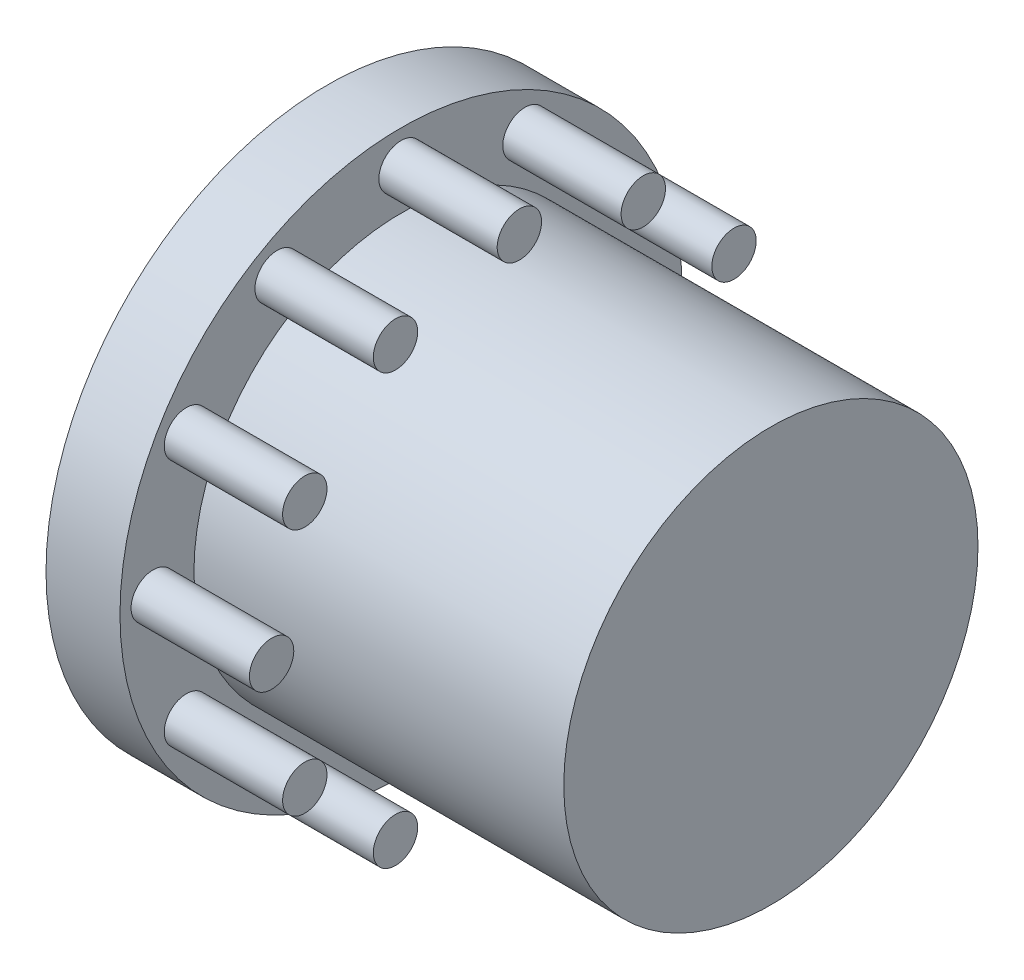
from build123d import *

# Parameters (mm, degrees)
SKETCH1_R           = 190
SKETCH1_R_2         = 140
SKETCH1_R_3         = 50
BOSS_EXTRUDE1_DEPTH = 50
SKETCH1_3_R         = 50
BOSS_EXTRUDE2_DEPTH = 50
BOSS_EXTRUDE3_START = 300
SKETCH1_4_R         = 140
SKETCH1_4_R_2       = 50
BOSS_EXTRUDE3_DEPTH = 300
SKETCH2_R           = 15
BOSS_EXTRUDE4_DEPTH = 80
CIRPATTERN1_COUNT   = 12


with BuildPart() as part:
    # Sketch1 → Boss-Extrude1 (new body)
    # profile 1 of 3: a face of its own
    with BuildSketch(Plane(origin=(0, 0, 0), x_dir=(0, 0, -1), z_dir=(1, 0, 0))):
        Circle(SKETCH1_R)
        Circle(SKETCH1_R_2, mode=Mode.SUBTRACT)
    # profile 2 of 3: a face of its own
    with BuildSketch(Plane(origin=(0, 0, 0), x_dir=(0, 0, -1), z_dir=(1, 0, 0))):
        Circle(SKETCH1_R_2)
        Circle(SKETCH1_R_3, mode=Mode.SUBTRACT)
    # profile 3 of 3: a face of its own
    with BuildSketch(Plane(origin=(0, 0, 0), x_dir=(0, 0, -1), z_dir=(1, 0, 0))):
        Circle(SKETCH1_R_3)
    extrude(amount=BOSS_EXTRUDE1_DEPTH)

    # Sketch1_3 → Boss-Extrude2 (add)
    with BuildSketch(Plane(origin=(0, 0, 0), x_dir=(0, 0, -1), z_dir=(1, 0, 0))):
        Circle(SKETCH1_3_R)
    extrude(amount=-BOSS_EXTRUDE2_DEPTH)

    # Sketch1_4 → Boss-Extrude3 (add)
    # profile 1 of 2: a face of its own
    with BuildSketch(Plane(origin=(0, 0, 0), x_dir=(0, 0, -1), z_dir=(1, 0, 0)).offset(BOSS_EXTRUDE3_START)):
        Circle(SKETCH1_4_R)
        Circle(SKETCH1_4_R_2, mode=Mode.SUBTRACT)
    # profile 2 of 2: a face of its own
    with BuildSketch(Plane(origin=(0, 0, 0), x_dir=(0, 0, -1), z_dir=(1, 0, 0)).offset(BOSS_EXTRUDE3_START)):
        Circle(SKETCH1_4_R_2)
    extrude(amount=-BOSS_EXTRUDE3_DEPTH)


with BuildPart() as body_2:
    # Sketch2 → Boss-Extrude4 (new body)
    with BuildSketch(Plane(origin=(50, 0, 0), x_dir=(0, 0, -1), z_dir=(1, 0, 0))):
        with Locations((0, 167.5)):
            Circle(SKETCH2_R)
    boss_extrude4 = extrude(amount=BOSS_EXTRUDE4_DEPTH)


with BuildPart() as part_1:
    add(part.part)

    # CirPattern1: Boss-Extrude4 ×12 about axis
    cirpattern1_axis = Axis((0, 0, 0), (1, 0, 0))
    for i in range(1, CIRPATTERN1_COUNT):
        add(boss_extrude4.rotate(cirpattern1_axis, i * 360 / CIRPATTERN1_COUNT))


solid = Compound([body_2.part, part_1.part])
